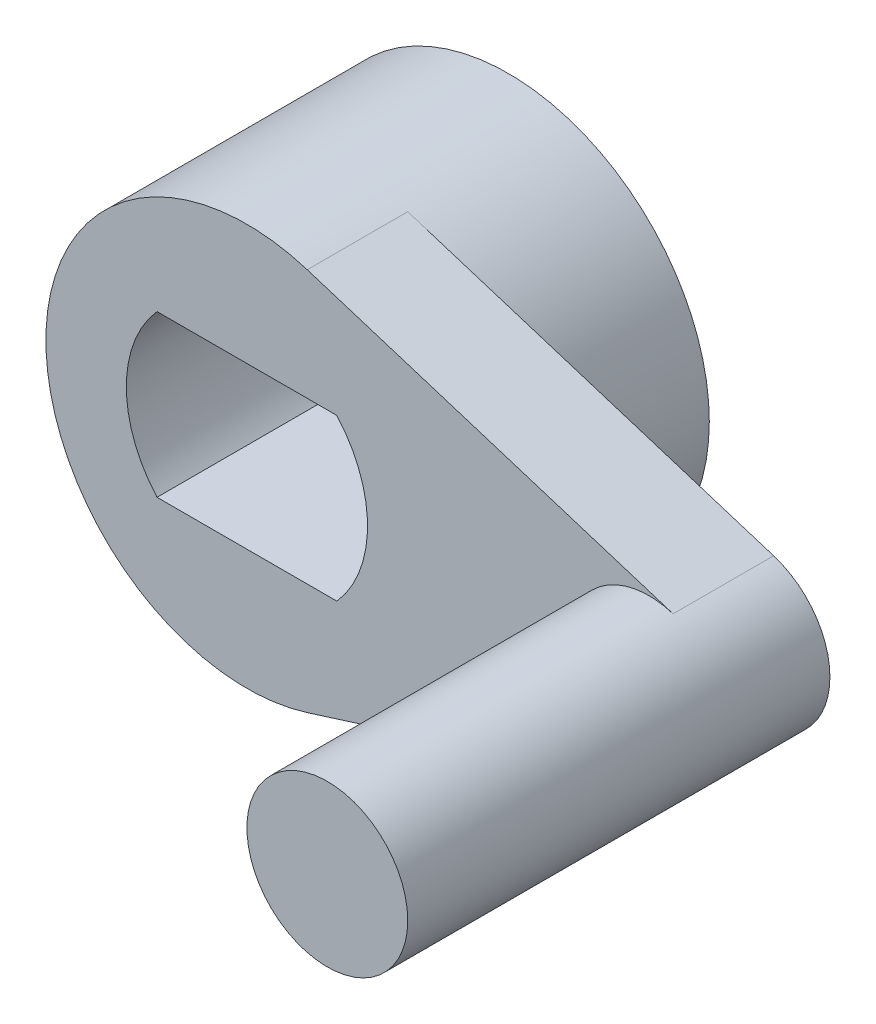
ISO-10303-21;
HEADER;
FILE_DESCRIPTION(('STEP AP214'),'2;1');
FILE_NAME('part.step','',(''),(''),'','','');
FILE_SCHEMA(('AUTOMOTIVE_DESIGN { 1 0 10303 214 1 1 1 1 }'));
ENDSEC;
DATA;
#1=APPLICATION_CONTEXT('core data for automotive mechanical design processes');
#2=APPLICATION_PROTOCOL_DEFINITION('international standard','automotive_design',2000,#1);
#3=PRODUCT_CONTEXT('',#1,'mechanical');
#4=PRODUCT('Part','Part','',(#3));
#5=PRODUCT_RELATED_PRODUCT_CATEGORY('part','',(#4));
#6=PRODUCT_DEFINITION_FORMATION('','',#4);
#7=PRODUCT_DEFINITION_CONTEXT('part definition',#1,'design');
#8=PRODUCT_DEFINITION('design','',#6,#7);
#9=PRODUCT_DEFINITION_SHAPE('','',#8);
#10=(LENGTH_UNIT() NAMED_UNIT(*) SI_UNIT(.MILLI.,.METRE.));
#11=(NAMED_UNIT(*) PLANE_ANGLE_UNIT() SI_UNIT($,.RADIAN.));
#12=(NAMED_UNIT(*) SI_UNIT($,.STERADIAN.) SOLID_ANGLE_UNIT());
#13=UNCERTAINTY_MEASURE_WITH_UNIT(LENGTH_MEASURE(1.E-05),#10,'distance_accuracy_value','');
#14=(GEOMETRIC_REPRESENTATION_CONTEXT(3) GLOBAL_UNCERTAINTY_ASSIGNED_CONTEXT((#13)) GLOBAL_UNIT_ASSIGNED_CONTEXT((#10,
#11,#12)) REPRESENTATION_CONTEXT('',''));
#15=CARTESIAN_POINT('',(0.,0.,0.));
#16=DIRECTION('',(0.,0.,1.));
#17=DIRECTION('',(1.,0.,0.));
#18=AXIS2_PLACEMENT_3D('',#15,#16,#17);
#19=CARTESIAN_POINT('',(0.,0.,6.5));
#20=DIRECTION('',(0.,0.,-1.));
#21=DIRECTION('',(-1.,0.,0.));
#22=AXIS2_PLACEMENT_3D('',#19,#20,#21);
#23=CYLINDRICAL_SURFACE('',#22,5.);
#24=CARTESIAN_POINT('',(0.,0.,6.5));
#25=DIRECTION('',(0.,0.,1.));
#26=DIRECTION('',(1.,0.,0.));
#27=AXIS2_PLACEMENT_3D('',#24,#25,#26);
#28=CIRCLE('',#27,5.);
#29=CARTESIAN_POINT('',(1.5,4.76969600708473,6.5));
#30=VERTEX_POINT('',#29);
#31=CARTESIAN_POINT('',(1.5,-4.76969600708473,6.5));
#32=VERTEX_POINT('',#31);
#33=EDGE_CURVE('E40',#30,#32,#28,.T.);
#34=ORIENTED_EDGE('',*,*,#33,.F.);
#35=DIRECTION('',(0.,0.,1.));
#36=VECTOR('',#35,1.);
#37=CARTESIAN_POINT('',(1.5,4.76969600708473,4.));
#38=LINE('',#37,#36);
#39=CARTESIAN_POINT('',(1.5,4.76969600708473,4.));
#40=VERTEX_POINT('',#39);
#41=EDGE_CURVE('E153',#40,#30,#38,.T.);
#42=ORIENTED_EDGE('',*,*,#41,.F.);
#43=CARTESIAN_POINT('',(0.,0.,4.));
#44=DIRECTION('',(0.,0.,1.));
#45=DIRECTION('',(1.,0.,0.));
#46=AXIS2_PLACEMENT_3D('',#43,#44,#45);
#47=CIRCLE('',#46,5.);
#48=CARTESIAN_POINT('',(1.5,-4.76969600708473,4.));
#49=VERTEX_POINT('',#48);
#50=EDGE_CURVE('E11',#49,#40,#47,.T.);
#51=ORIENTED_EDGE('',*,*,#50,.F.);
#52=DIRECTION('',(0.,0.,1.));
#53=VECTOR('',#52,1.);
#54=CARTESIAN_POINT('',(1.5,-4.76969600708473,4.));
#55=LINE('',#54,#53);
#56=EDGE_CURVE('E158',#49,#32,#55,.T.);
#57=ORIENTED_EDGE('',*,*,#56,.T.);
#58=EDGE_LOOP('',(#34,#42,#51,#57));
#59=FACE_BOUND('',#58,.T.);
#60=CARTESIAN_POINT('',(0.,0.,0.));
#61=DIRECTION('',(0.,0.,1.));
#62=DIRECTION('',(1.,0.,0.));
#63=AXIS2_PLACEMENT_3D('',#60,#61,#62);
#64=CIRCLE('',#63,5.);
#65=CARTESIAN_POINT('',(5.,0.,0.));
#66=VERTEX_POINT('',#65);
#67=EDGE_CURVE('E181',#66,#66,#64,.T.);
#68=ORIENTED_EDGE('',*,*,#67,.T.);
#69=EDGE_LOOP('',(#68));
#70=FACE_BOUND('',#69,.T.);
#71=ADVANCED_FACE('F32',(#59,#70),#23,.T.);
#72=CARTESIAN_POINT('',(0.,0.,6.5));
#73=DIRECTION('',(0.,0.,1.));
#74=DIRECTION('',(1.,0.,0.));
#75=AXIS2_PLACEMENT_3D('',#72,#73,#74);
#76=PLANE('',#75);
#77=CARTESIAN_POINT('',(0.,0.,6.5));
#78=DIRECTION('',(0.,0.,1.));
#79=DIRECTION('',(1.,0.,0.));
#80=AXIS2_PLACEMENT_3D('',#77,#78,#79);
#81=CIRCLE('',#80,3.);
#82=CARTESIAN_POINT('',(-2.23606797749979,2.,6.5));
#83=VERTEX_POINT('',#82);
#84=CARTESIAN_POINT('',(-2.23606797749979,-2.,6.5));
#85=VERTEX_POINT('',#84);
#86=EDGE_CURVE('E48',#83,#85,#81,.T.);
#87=ORIENTED_EDGE('',*,*,#86,.F.);
#88=DIRECTION('',(-1.,0.,0.));
#89=VECTOR('',#88,1.);
#90=CARTESIAN_POINT('',(-2.23606797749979,2.,6.5));
#91=LINE('',#90,#89);
#92=CARTESIAN_POINT('',(2.23606797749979,2.,6.5));
#93=VERTEX_POINT('',#92);
#94=EDGE_CURVE('E115',#93,#83,#91,.T.);
#95=ORIENTED_EDGE('',*,*,#94,.F.);
#96=CARTESIAN_POINT('',(0.,0.,6.5));
#97=DIRECTION('',(0.,0.,1.));
#98=DIRECTION('',(1.,0.,0.));
#99=AXIS2_PLACEMENT_3D('',#96,#97,#98);
#100=CIRCLE('',#99,3.);
#101=CARTESIAN_POINT('',(2.23606797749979,-2.,6.5));
#102=VERTEX_POINT('',#101);
#103=EDGE_CURVE('E99',#102,#93,#100,.T.);
#104=ORIENTED_EDGE('',*,*,#103,.F.);
#105=DIRECTION('',(1.,0.,0.));
#106=VECTOR('',#105,1.);
#107=CARTESIAN_POINT('',(-2.23606797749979,-2.,6.5));
#108=LINE('',#107,#106);
#109=EDGE_CURVE('E108',#85,#102,#108,.T.);
#110=ORIENTED_EDGE('',*,*,#109,.F.);
#111=EDGE_LOOP('',(#87,#95,#104,#110));
#112=FACE_BOUND('',#111,.T.);
#113=CARTESIAN_POINT('',(10.,0.,6.5));
#114=DIRECTION('',(0.,0.,1.));
#115=DIRECTION('',(1.,0.,0.));
#116=AXIS2_PLACEMENT_3D('',#113,#114,#115);
#117=CIRCLE('',#116,2.);
#118=CARTESIAN_POINT('',(10.6,1.90787840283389,6.5));
#119=VERTEX_POINT('',#118);
#120=CARTESIAN_POINT('',(10.6,-1.90787840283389,6.5));
#121=VERTEX_POINT('',#120);
#122=EDGE_CURVE('E131',#119,#121,#117,.T.);
#123=ORIENTED_EDGE('',*,*,#122,.F.);
#124=DIRECTION('',(-0.953939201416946,0.3,0.));
#125=VECTOR('',#124,1.);
#126=CARTESIAN_POINT('',(1.5,4.76969600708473,6.5));
#127=LINE('',#126,#125);
#128=EDGE_CURVE('E146',#119,#30,#127,.T.);
#129=ORIENTED_EDGE('',*,*,#128,.T.);
#130=ORIENTED_EDGE('',*,*,#33,.T.);
#131=DIRECTION('',(0.953939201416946,0.3,0.));
#132=VECTOR('',#131,1.);
#133=CARTESIAN_POINT('',(1.5,-4.76969600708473,6.5));
#134=LINE('',#133,#132);
#135=EDGE_CURVE('E137',#32,#121,#134,.T.);
#136=ORIENTED_EDGE('',*,*,#135,.T.);
#137=EDGE_LOOP('',(#123,#129,#130,#136));
#138=FACE_BOUND('',#137,.T.);
#139=ADVANCED_FACE('F112',(#112,#138),#76,.T.);
#140=CARTESIAN_POINT('',(0.,0.,0.));
#141=DIRECTION('',(0.,0.,1.));
#142=DIRECTION('',(1.,0.,0.));
#143=AXIS2_PLACEMENT_3D('',#140,#141,#142);
#144=PLANE('',#143);
#145=DIRECTION('',(-1.,0.,0.));
#146=VECTOR('',#145,1.);
#147=CARTESIAN_POINT('',(-2.23606797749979,2.,0.));
#148=LINE('',#147,#146);
#149=CARTESIAN_POINT('',(2.23606797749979,2.,0.));
#150=VERTEX_POINT('',#149);
#151=CARTESIAN_POINT('',(-2.23606797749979,2.,0.));
#152=VERTEX_POINT('',#151);
#153=EDGE_CURVE('E126',#150,#152,#148,.T.);
#154=ORIENTED_EDGE('',*,*,#153,.T.);
#155=CARTESIAN_POINT('',(0.,0.,0.));
#156=DIRECTION('',(0.,0.,1.));
#157=DIRECTION('',(1.,0.,0.));
#158=AXIS2_PLACEMENT_3D('',#155,#156,#157);
#159=CIRCLE('',#158,3.);
#160=CARTESIAN_POINT('',(-2.23606797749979,-2.,0.));
#161=VERTEX_POINT('',#160);
#162=EDGE_CURVE('E117',#152,#161,#159,.T.);
#163=ORIENTED_EDGE('',*,*,#162,.T.);
#164=DIRECTION('',(1.,0.,0.));
#165=VECTOR('',#164,1.);
#166=CARTESIAN_POINT('',(-2.23606797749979,-2.,0.));
#167=LINE('',#166,#165);
#168=CARTESIAN_POINT('',(2.23606797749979,-2.,0.));
#169=VERTEX_POINT('',#168);
#170=EDGE_CURVE('E123',#161,#169,#167,.T.);
#171=ORIENTED_EDGE('',*,*,#170,.T.);
#172=CARTESIAN_POINT('',(0.,0.,0.));
#173=DIRECTION('',(0.,0.,1.));
#174=DIRECTION('',(1.,0.,0.));
#175=AXIS2_PLACEMENT_3D('',#172,#173,#174);
#176=CIRCLE('',#175,3.);
#177=EDGE_CURVE('E56',#169,#150,#176,.T.);
#178=ORIENTED_EDGE('',*,*,#177,.T.);
#179=EDGE_LOOP('',(#154,#163,#171,#178));
#180=FACE_BOUND('',#179,.T.);
#181=ORIENTED_EDGE('',*,*,#67,.F.);
#182=EDGE_LOOP('',(#181));
#183=FACE_BOUND('',#182,.T.);
#184=ADVANCED_FACE('F194',(#180,#183),#144,.F.);
#185=CARTESIAN_POINT('',(0.,0.,4.));
#186=DIRECTION('',(0.,0.,1.));
#187=DIRECTION('',(1.,0.,0.));
#188=AXIS2_PLACEMENT_3D('',#185,#186,#187);
#189=PLANE('',#188);
#190=DIRECTION('',(0.953939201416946,0.3,0.));
#191=VECTOR('',#190,1.);
#192=CARTESIAN_POINT('',(1.5,-4.76969600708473,4.));
#193=LINE('',#192,#191);
#194=CARTESIAN_POINT('',(10.6,-1.90787840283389,4.));
#195=VERTEX_POINT('',#194);
#196=EDGE_CURVE('E141',#49,#195,#193,.T.);
#197=ORIENTED_EDGE('',*,*,#196,.F.);
#198=ORIENTED_EDGE('',*,*,#50,.T.);
#199=DIRECTION('',(-0.953939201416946,0.3,0.));
#200=VECTOR('',#199,1.);
#201=CARTESIAN_POINT('',(1.5,4.76969600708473,4.));
#202=LINE('',#201,#200);
#203=CARTESIAN_POINT('',(10.6,1.90787840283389,4.));
#204=VERTEX_POINT('',#203);
#205=EDGE_CURVE('E177',#204,#40,#202,.T.);
#206=ORIENTED_EDGE('',*,*,#205,.F.);
#207=CARTESIAN_POINT('',(10.,0.,4.));
#208=DIRECTION('',(0.,0.,1.));
#209=DIRECTION('',(1.,0.,0.));
#210=AXIS2_PLACEMENT_3D('',#207,#208,#209);
#211=CIRCLE('',#210,2.);
#212=EDGE_CURVE('E171',#195,#204,#211,.T.);
#213=ORIENTED_EDGE('',*,*,#212,.F.);
#214=EDGE_LOOP('',(#197,#198,#206,#213));
#215=FACE_BOUND('',#214,.T.);
#216=ADVANCED_FACE('F192',(#215),#189,.F.);
#217=CARTESIAN_POINT('',(1.5,4.76969600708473,4.));
#218=DIRECTION('',(0.3,0.953939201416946,0.));
#219=DIRECTION('',(-0.953939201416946,0.3,0.));
#220=AXIS2_PLACEMENT_3D('',#217,#218,#219);
#221=PLANE('',#220);
#222=ORIENTED_EDGE('',*,*,#128,.F.);
#223=DIRECTION('',(0.,0.,1.));
#224=VECTOR('',#223,1.);
#225=CARTESIAN_POINT('',(10.6,1.90787840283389,4.));
#226=LINE('',#225,#224);
#227=EDGE_CURVE('E150',#204,#119,#226,.T.);
#228=ORIENTED_EDGE('',*,*,#227,.F.);
#229=ORIENTED_EDGE('',*,*,#205,.T.);
#230=ORIENTED_EDGE('',*,*,#41,.T.);
#231=EDGE_LOOP('',(#222,#228,#229,#230));
#232=FACE_BOUND('',#231,.T.);
#233=ADVANCED_FACE('F175',(#232),#221,.T.);
#234=CARTESIAN_POINT('',(10.,0.,4.));
#235=DIRECTION('',(0.,0.,1.));
#236=DIRECTION('',(1.,0.,0.));
#237=AXIS2_PLACEMENT_3D('',#234,#235,#236);
#238=CYLINDRICAL_SURFACE('',#237,2.);
#239=ORIENTED_EDGE('',*,*,#227,.T.);
#240=ORIENTED_EDGE('',*,*,#122,.T.);
#241=DIRECTION('',(0.,0.,1.));
#242=VECTOR('',#241,1.);
#243=CARTESIAN_POINT('',(10.6,-1.90787840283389,4.));
#244=LINE('',#243,#242);
#245=EDGE_CURVE('E154',#195,#121,#244,.T.);
#246=ORIENTED_EDGE('',*,*,#245,.F.);
#247=ORIENTED_EDGE('',*,*,#212,.T.);
#248=EDGE_LOOP('',(#239,#240,#246,#247));
#249=FACE_BOUND('',#248,.T.);
#250=CARTESIAN_POINT('',(10.,0.,14.5));
#251=DIRECTION('',(0.,0.,1.));
#252=DIRECTION('',(1.,0.,0.));
#253=AXIS2_PLACEMENT_3D('',#250,#251,#252);
#254=CIRCLE('',#253,2.);
#255=CARTESIAN_POINT('',(12.,0.,14.5));
#256=VERTEX_POINT('',#255);
#257=EDGE_CURVE('E134',#256,#256,#254,.T.);
#258=ORIENTED_EDGE('',*,*,#257,.F.);
#259=EDGE_LOOP('',(#258));
#260=FACE_BOUND('',#259,.T.);
#261=ADVANCED_FACE('F167',(#249,#260),#238,.T.);
#262=CARTESIAN_POINT('',(1.5,-4.76969600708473,4.));
#263=DIRECTION('',(0.3,-0.953939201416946,0.));
#264=DIRECTION('',(0.953939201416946,0.3,0.));
#265=AXIS2_PLACEMENT_3D('',#262,#263,#264);
#266=PLANE('',#265);
#267=ORIENTED_EDGE('',*,*,#135,.F.);
#268=ORIENTED_EDGE('',*,*,#56,.F.);
#269=ORIENTED_EDGE('',*,*,#196,.T.);
#270=ORIENTED_EDGE('',*,*,#245,.T.);
#271=EDGE_LOOP('',(#267,#268,#269,#270));
#272=FACE_BOUND('',#271,.T.);
#273=ADVANCED_FACE('F190',(#272),#266,.T.);
#274=CARTESIAN_POINT('',(10.,0.,14.5));
#275=DIRECTION('',(0.,0.,1.));
#276=DIRECTION('',(1.,0.,0.));
#277=AXIS2_PLACEMENT_3D('',#274,#275,#276);
#278=PLANE('',#277);
#279=ORIENTED_EDGE('',*,*,#257,.T.);
#280=EDGE_LOOP('',(#279));
#281=FACE_BOUND('',#280,.T.);
#282=ADVANCED_FACE('F213',(#281),#278,.T.);
#283=CARTESIAN_POINT('',(0.,0.,0.));
#284=DIRECTION('',(0.,0.,1.));
#285=DIRECTION('',(1.,0.,0.));
#286=AXIS2_PLACEMENT_3D('',#283,#284,#285);
#287=CYLINDRICAL_SURFACE('',#286,3.);
#288=ORIENTED_EDGE('',*,*,#86,.T.);
#289=DIRECTION('',(0.,0.,1.));
#290=VECTOR('',#289,1.);
#291=CARTESIAN_POINT('',(-2.23606797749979,-2.,0.));
#292=LINE('',#291,#290);
#293=EDGE_CURVE('E105',#161,#85,#292,.T.);
#294=ORIENTED_EDGE('',*,*,#293,.F.);
#295=ORIENTED_EDGE('',*,*,#162,.F.);
#296=DIRECTION('',(0.,0.,1.));
#297=VECTOR('',#296,1.);
#298=CARTESIAN_POINT('',(-2.23606797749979,2.,0.));
#299=LINE('',#298,#297);
#300=EDGE_CURVE('E129',#152,#83,#299,.T.);
#301=ORIENTED_EDGE('',*,*,#300,.T.);
#302=EDGE_LOOP('',(#288,#294,#295,#301));
#303=FACE_BOUND('',#302,.T.);
#304=ADVANCED_FACE('F230',(#303),#287,.F.);
#305=CARTESIAN_POINT('',(-2.23606797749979,2.,0.));
#306=DIRECTION('',(0.,1.,0.));
#307=DIRECTION('',(0.,0.,1.));
#308=AXIS2_PLACEMENT_3D('',#305,#306,#307);
#309=PLANE('',#308);
#310=ORIENTED_EDGE('',*,*,#94,.T.);
#311=ORIENTED_EDGE('',*,*,#300,.F.);
#312=ORIENTED_EDGE('',*,*,#153,.F.);
#313=DIRECTION('',(0.,0.,1.));
#314=VECTOR('',#313,1.);
#315=CARTESIAN_POINT('',(2.23606797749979,2.,0.));
#316=LINE('',#315,#314);
#317=EDGE_CURVE('E104',#150,#93,#316,.T.);
#318=ORIENTED_EDGE('',*,*,#317,.T.);
#319=EDGE_LOOP('',(#310,#311,#312,#318));
#320=FACE_BOUND('',#319,.T.);
#321=ADVANCED_FACE('F236',(#320),#309,.F.);
#322=CARTESIAN_POINT('',(0.,0.,0.));
#323=DIRECTION('',(0.,0.,1.));
#324=DIRECTION('',(1.,0.,0.));
#325=AXIS2_PLACEMENT_3D('',#322,#323,#324);
#326=CYLINDRICAL_SURFACE('',#325,3.);
#327=ORIENTED_EDGE('',*,*,#103,.T.);
#328=ORIENTED_EDGE('',*,*,#317,.F.);
#329=ORIENTED_EDGE('',*,*,#177,.F.);
#330=DIRECTION('',(0.,0.,1.));
#331=VECTOR('',#330,1.);
#332=CARTESIAN_POINT('',(2.23606797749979,-2.,0.));
#333=LINE('',#332,#331);
#334=EDGE_CURVE('E95',#169,#102,#333,.T.);
#335=ORIENTED_EDGE('',*,*,#334,.T.);
#336=EDGE_LOOP('',(#327,#328,#329,#335));
#337=FACE_BOUND('',#336,.T.);
#338=ADVANCED_FACE('F97',(#337),#326,.F.);
#339=CARTESIAN_POINT('',(-2.23606797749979,-2.,0.));
#340=DIRECTION('',(0.,-1.,0.));
#341=DIRECTION('',(0.,0.,-1.));
#342=AXIS2_PLACEMENT_3D('',#339,#340,#341);
#343=PLANE('',#342);
#344=ORIENTED_EDGE('',*,*,#109,.T.);
#345=ORIENTED_EDGE('',*,*,#334,.F.);
#346=ORIENTED_EDGE('',*,*,#170,.F.);
#347=ORIENTED_EDGE('',*,*,#293,.T.);
#348=EDGE_LOOP('',(#344,#345,#346,#347));
#349=FACE_BOUND('',#348,.T.);
#350=ADVANCED_FACE('F109',(#349),#343,.F.);
#351=CLOSED_SHELL('',(#71,#139,#184,#216,#233,#261,#273,#282,#304,#321,#338,#350));
#352=MANIFOLD_SOLID_BREP('B2',#351);
#353=ADVANCED_BREP_SHAPE_REPRESENTATION('',(#18,#352),#14);
#354=SHAPE_DEFINITION_REPRESENTATION(#9,#353);
ENDSEC;
END-ISO-10303-21;
